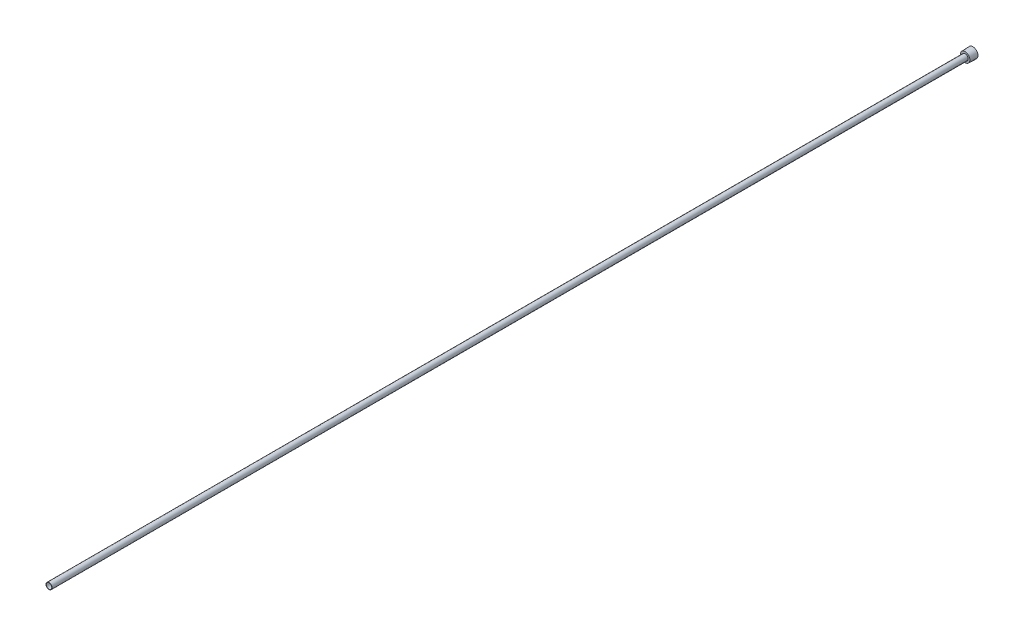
ISO-10303-21;
HEADER;
FILE_DESCRIPTION(('STEP AP214'),'2;1');
FILE_NAME('part.step','',(''),(''),'','','');
FILE_SCHEMA(('AUTOMOTIVE_DESIGN { 1 0 10303 214 1 1 1 1 }'));
ENDSEC;
DATA;
#1=APPLICATION_CONTEXT('core data for automotive mechanical design processes');
#2=APPLICATION_PROTOCOL_DEFINITION('international standard','automotive_design',2000,#1);
#3=PRODUCT_CONTEXT('',#1,'mechanical');
#4=PRODUCT('Part','Part','',(#3));
#5=PRODUCT_RELATED_PRODUCT_CATEGORY('part','',(#4));
#6=PRODUCT_DEFINITION_FORMATION('','',#4);
#7=PRODUCT_DEFINITION_CONTEXT('part definition',#1,'design');
#8=PRODUCT_DEFINITION('design','',#6,#7);
#9=PRODUCT_DEFINITION_SHAPE('','',#8);
#10=(LENGTH_UNIT() NAMED_UNIT(*) SI_UNIT(.MILLI.,.METRE.));
#11=(NAMED_UNIT(*) PLANE_ANGLE_UNIT() SI_UNIT($,.RADIAN.));
#12=(NAMED_UNIT(*) SI_UNIT($,.STERADIAN.) SOLID_ANGLE_UNIT());
#13=UNCERTAINTY_MEASURE_WITH_UNIT(LENGTH_MEASURE(1.E-05),#10,'distance_accuracy_value','');
#14=(GEOMETRIC_REPRESENTATION_CONTEXT(3) GLOBAL_UNCERTAINTY_ASSIGNED_CONTEXT((#13)) GLOBAL_UNIT_ASSIGNED_CONTEXT((#10,
#11,#12)) REPRESENTATION_CONTEXT('',''));
#15=CARTESIAN_POINT('',(0.,0.,0.));
#16=DIRECTION('',(0.,0.,1.));
#17=DIRECTION('',(1.,0.,0.));
#18=AXIS2_PLACEMENT_3D('',#15,#16,#17);
#19=CARTESIAN_POINT('',(0.,0.,0.));
#20=DIRECTION('',(0.,0.,1.));
#21=DIRECTION('',(1.,0.,0.));
#22=AXIS2_PLACEMENT_3D('',#19,#20,#21);
#23=CYLINDRICAL_SURFACE('',#22,3.65125);
#24=CARTESIAN_POINT('',(0.,0.,1219.2));
#25=DIRECTION('',(0.,0.,1.));
#26=DIRECTION('',(1.,0.,0.));
#27=AXIS2_PLACEMENT_3D('',#24,#25,#26);
#28=CIRCLE('',#27,3.65125);
#29=CARTESIAN_POINT('',(3.65125,0.,1219.2));
#30=VERTEX_POINT('',#29);
#31=EDGE_CURVE('E141',#30,#30,#28,.T.);
#32=CARTESIAN_POINT('',(0.,0.,6.35));
#33=DIRECTION('',(0.,0.,-1.));
#34=DIRECTION('',(-1.,0.,0.));
#35=AXIS2_PLACEMENT_3D('',#32,#33,#34);
#36=CIRCLE('',#35,3.65125);
#37=CARTESIAN_POINT('',(3.65125,0.,6.35));
#38=VERTEX_POINT('',#37);
#39=EDGE_CURVE('E36',#38,#38,#36,.F.);
#40=CARTESIAN_POINT('',(3.65125,0.,1219.2));
#41=CARTESIAN_POINT('',(3.65125,0.,1206.56614583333));
#42=CARTESIAN_POINT('',(3.65125,0.,1193.93229166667));
#43=CARTESIAN_POINT('',(3.65125,0.,1168.66458333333));
#44=CARTESIAN_POINT('',(3.65125,0.,1156.03072916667));
#45=CARTESIAN_POINT('',(3.65125,0.,1130.76302083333));
#46=CARTESIAN_POINT('',(3.65125,0.,1118.12916666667));
#47=CARTESIAN_POINT('',(3.65125,0.,1092.86145833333));
#48=CARTESIAN_POINT('',(3.65125,0.,1080.22760416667));
#49=CARTESIAN_POINT('',(3.65125,0.,1054.95989583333));
#50=CARTESIAN_POINT('',(3.65125,0.,1042.32604166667));
#51=CARTESIAN_POINT('',(3.65125,0.,1017.05833333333));
#52=CARTESIAN_POINT('',(3.65125,0.,1004.42447916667));
#53=CARTESIAN_POINT('',(3.65125,0.,979.156770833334));
#54=CARTESIAN_POINT('',(3.65125,0.,966.522916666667));
#55=CARTESIAN_POINT('',(3.65125,0.,941.255208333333));
#56=CARTESIAN_POINT('',(3.65125,0.,928.621354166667));
#57=CARTESIAN_POINT('',(3.65125,0.,903.353645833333));
#58=CARTESIAN_POINT('',(3.65125,0.,890.719791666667));
#59=CARTESIAN_POINT('',(3.65125,0.,865.452083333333));
#60=CARTESIAN_POINT('',(3.65125,0.,852.818229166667));
#61=CARTESIAN_POINT('',(3.65125,0.,827.550520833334));
#62=CARTESIAN_POINT('',(3.65125,0.,814.916666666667));
#63=CARTESIAN_POINT('',(3.65125,0.,789.648958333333));
#64=CARTESIAN_POINT('',(3.65125,0.,777.015104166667));
#65=CARTESIAN_POINT('',(3.65125,0.,751.747395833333));
#66=CARTESIAN_POINT('',(3.65125,0.,739.113541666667));
#67=CARTESIAN_POINT('',(3.65125,0.,713.845833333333));
#68=CARTESIAN_POINT('',(3.65125,0.,701.211979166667));
#69=CARTESIAN_POINT('',(3.65125,0.,675.944270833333));
#70=CARTESIAN_POINT('',(3.65125,0.,663.310416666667));
#71=CARTESIAN_POINT('',(3.65125,0.,638.042708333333));
#72=CARTESIAN_POINT('',(3.65125,0.,625.408854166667));
#73=CARTESIAN_POINT('',(3.65125,0.,600.141145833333));
#74=CARTESIAN_POINT('',(3.65125,0.,587.507291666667));
#75=CARTESIAN_POINT('',(3.65125,0.,562.239583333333));
#76=CARTESIAN_POINT('',(3.65125,0.,549.605729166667));
#77=CARTESIAN_POINT('',(3.65125,0.,524.338020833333));
#78=CARTESIAN_POINT('',(3.65125,0.,511.704166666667));
#79=CARTESIAN_POINT('',(3.65125,0.,486.436458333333));
#80=CARTESIAN_POINT('',(3.65125,0.,473.802604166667));
#81=CARTESIAN_POINT('',(3.65125,0.,448.534895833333));
#82=CARTESIAN_POINT('',(3.65125,0.,435.901041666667));
#83=CARTESIAN_POINT('',(3.65125,0.,410.633333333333));
#84=CARTESIAN_POINT('',(3.65125,0.,397.999479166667));
#85=CARTESIAN_POINT('',(3.65125,0.,372.731770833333));
#86=CARTESIAN_POINT('',(3.65125,0.,360.097916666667));
#87=CARTESIAN_POINT('',(3.65125,0.,334.830208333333));
#88=CARTESIAN_POINT('',(3.65125,0.,322.196354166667));
#89=CARTESIAN_POINT('',(3.65125,0.,296.928645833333));
#90=CARTESIAN_POINT('',(3.65125,0.,284.294791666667));
#91=CARTESIAN_POINT('',(3.65125,0.,259.027083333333));
#92=CARTESIAN_POINT('',(3.65125,0.,246.393229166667));
#93=CARTESIAN_POINT('',(3.65125,0.,221.125520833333));
#94=CARTESIAN_POINT('',(3.65125,0.,208.491666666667));
#95=CARTESIAN_POINT('',(3.65125,0.,183.223958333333));
#96=CARTESIAN_POINT('',(3.65125,0.,170.590104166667));
#97=CARTESIAN_POINT('',(3.65125,0.,145.322395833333));
#98=CARTESIAN_POINT('',(3.65125,0.,132.688541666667));
#99=CARTESIAN_POINT('',(3.65125,0.,107.420833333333));
#100=CARTESIAN_POINT('',(3.65125,0.,94.7869791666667));
#101=CARTESIAN_POINT('',(3.65125,0.,69.5192708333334));
#102=CARTESIAN_POINT('',(3.65125,0.,56.8854166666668));
#103=CARTESIAN_POINT('',(3.65125,0.,31.6177083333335));
#104=CARTESIAN_POINT('',(3.65125,0.,18.9838541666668));
#105=CARTESIAN_POINT('',(3.65125,0.,6.35000000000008));
#106=B_SPLINE_CURVE_WITH_KNOTS('',3,(#40,#41,#42,#43,#44,#45,#46,#47,#48,#49,#50,#51,#52,#53,
#54,#55,#56,#57,#58,#59,#60,#61,#62,#63,#64,#65,#66,#67,#68,#69,#70,#71,#72,#73,#74,#75,#76,#77,
#78,#79,#80,#81,#82,#83,#84,#85,#86,#87,#88,#89,#90,#91,#92,#93,#94,#95,#96,#97,#98,#99,#100,
#101,#102,#103,#104,#105),.UNSPECIFIED.,.F.,.F.,(4,2,2,2,2,2,2,2,2,2,2,2,2,2,2,2,2,2,2,2,2,2,2,
2,2,2,2,2,2,2,2,2,4),(0.,37.9015625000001,75.803125,113.7046875,151.60625,189.5078125,
227.409375,265.3109375,303.2125,341.1140625,379.015625,416.9171875,454.81875,492.7203125,
530.621875,568.5234375,606.425,644.3265625,682.228125,720.1296875,758.03125,795.9328125,
833.834375,871.7359375,909.6375,947.5390625,985.440625,1023.3421875,1061.24375,1099.1453125,
1137.046875,1174.9484375,1212.85),.UNSPECIFIED.);
#107=EDGE_CURVE('BSEAM32',#30,#38,#106,.T.);
#108=ORIENTED_EDGE('',*,*,#31,.T.);
#109=ORIENTED_EDGE('',*,*,#39,.F.);
#110=ORIENTED_EDGE('',*,*,#107,.T.);
#111=ORIENTED_EDGE('',*,*,#107,.F.);
#112=EDGE_LOOP('',(#108,#110,#109,#111));
#113=FACE_BOUND('',#112,.T.);
#114=ADVANCED_FACE('F32',(#113),#23,.F.);
#115=CARTESIAN_POINT('',(0.,0.,0.));
#116=DIRECTION('',(0.,0.,-1.));
#117=DIRECTION('',(-1.,0.,0.));
#118=AXIS2_PLACEMENT_3D('',#115,#116,#117);
#119=CONICAL_SURFACE('',#118,6.7183,0.0364599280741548);
#120=CARTESIAN_POINT('',(0.,0.,10.3124));
#121=DIRECTION('',(0.,0.,1.));
#122=DIRECTION('',(1.,0.,0.));
#123=AXIS2_PLACEMENT_3D('',#120,#121,#122);
#124=CIRCLE('',#123,6.34214394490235);
#125=CARTESIAN_POINT('',(6.34214394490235,0.,10.3124));
#126=VERTEX_POINT('',#125);
#127=EDGE_CURVE('E11',#126,#126,#124,.T.);
#128=ORIENTED_EDGE('',*,*,#127,.F.);
#129=EDGE_LOOP('',(#128));
#130=FACE_BOUND('',#129,.T.);
#131=CARTESIAN_POINT('',(0.,0.,0.));
#132=DIRECTION('',(0.,0.,1.));
#133=DIRECTION('',(1.,0.,0.));
#134=AXIS2_PLACEMENT_3D('',#131,#132,#133);
#135=CIRCLE('',#134,6.7183);
#136=CARTESIAN_POINT('',(6.7183,0.,0.));
#137=VERTEX_POINT('',#136);
#138=EDGE_CURVE('E144',#137,#137,#135,.T.);
#139=ORIENTED_EDGE('',*,*,#138,.T.);
#140=EDGE_LOOP('',(#139));
#141=FACE_BOUND('',#140,.T.);
#142=ADVANCED_FACE('F34',(#130,#141),#119,.T.);
#143=CARTESIAN_POINT('',(0.,6.34214394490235,10.3124));
#144=DIRECTION('',(0.,0.,-1.));
#145=DIRECTION('',(-1.,0.,0.));
#146=AXIS2_PLACEMENT_3D('',#143,#144,#145);
#147=PLANE('',#146);
#148=CARTESIAN_POINT('',(0.,0.,10.3124));
#149=DIRECTION('',(0.,0.,1.));
#150=DIRECTION('',(1.,0.,0.));
#151=AXIS2_PLACEMENT_3D('',#148,#149,#150);
#152=CIRCLE('',#151,3.96875);
#153=CARTESIAN_POINT('',(3.96875,0.,10.3124));
#154=VERTEX_POINT('',#153);
#155=EDGE_CURVE('E41',#154,#154,#152,.T.);
#156=ORIENTED_EDGE('',*,*,#155,.F.);
#157=EDGE_LOOP('',(#156));
#158=FACE_BOUND('',#157,.T.);
#159=ORIENTED_EDGE('',*,*,#127,.T.);
#160=EDGE_LOOP('',(#159));
#161=FACE_BOUND('',#160,.T.);
#162=ADVANCED_FACE('F155',(#158,#161),#147,.F.);
#163=CARTESIAN_POINT('',(0.,0.,331.124179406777));
#164=DIRECTION('',(0.,0.,1.));
#165=DIRECTION('',(1.,0.,0.));
#166=AXIS2_PLACEMENT_3D('',#163,#164,#165);
#167=CYLINDRICAL_SURFACE('',#166,3.96874999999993);
#168=CARTESIAN_POINT('',(0.,0.,1219.2));
#169=DIRECTION('',(0.,0.,1.));
#170=DIRECTION('',(1.,0.,0.));
#171=AXIS2_PLACEMENT_3D('',#168,#169,#170);
#172=CIRCLE('',#171,3.96874999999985);
#173=CARTESIAN_POINT('',(3.96874999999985,0.,1219.2));
#174=VERTEX_POINT('',#173);
#175=EDGE_CURVE('E147',#174,#174,#172,.T.);
#176=ORIENTED_EDGE('',*,*,#175,.F.);
#177=EDGE_LOOP('',(#176));
#178=FACE_BOUND('',#177,.T.);
#179=ORIENTED_EDGE('',*,*,#155,.T.);
#180=EDGE_LOOP('',(#179));
#181=FACE_BOUND('',#180,.T.);
#182=ADVANCED_FACE('F153',(#178,#181),#167,.T.);
#183=CARTESIAN_POINT('',(0.,3.96874999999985,1219.2));
#184=DIRECTION('',(0.,0.,-1.));
#185=DIRECTION('',(-1.,0.,0.));
#186=AXIS2_PLACEMENT_3D('',#183,#184,#185);
#187=PLANE('',#186);
#188=ORIENTED_EDGE('',*,*,#31,.F.);
#189=EDGE_LOOP('',(#188));
#190=FACE_BOUND('',#189,.T.);
#191=ORIENTED_EDGE('',*,*,#175,.T.);
#192=EDGE_LOOP('',(#191));
#193=FACE_BOUND('',#192,.T.);
#194=ADVANCED_FACE('F166',(#190,#193),#187,.F.);
#195=CARTESIAN_POINT('',(0.,0.,0.));
#196=DIRECTION('',(0.,0.,1.));
#197=DIRECTION('',(1.,0.,0.));
#198=AXIS2_PLACEMENT_3D('',#195,#196,#197);
#199=PLANE('',#198);
#200=DIRECTION('',(-0.866025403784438,-0.5,0.));
#201=VECTOR('',#200,1.);
#202=CARTESIAN_POINT('',(4.7625,-2.74963065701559,0.));
#203=LINE('',#202,#201);
#204=CARTESIAN_POINT('',(4.7625,-2.74963065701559,0.));
#205=VERTEX_POINT('',#204);
#206=CARTESIAN_POINT('',(0.,-5.49926131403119,0.));
#207=VERTEX_POINT('',#206);
#208=EDGE_CURVE('E123',#205,#207,#203,.T.);
#209=ORIENTED_EDGE('',*,*,#208,.F.);
#210=DIRECTION('',(0.,-1.,0.));
#211=VECTOR('',#210,1.);
#212=CARTESIAN_POINT('',(4.7625,2.74963065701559,0.));
#213=LINE('',#212,#211);
#214=CARTESIAN_POINT('',(4.7625,2.74963065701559,0.));
#215=VERTEX_POINT('',#214);
#216=EDGE_CURVE('E48',#215,#205,#213,.T.);
#217=ORIENTED_EDGE('',*,*,#216,.F.);
#218=DIRECTION('',(0.866025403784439,-0.5,0.));
#219=VECTOR('',#218,1.);
#220=CARTESIAN_POINT('',(0.,5.49926131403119,0.));
#221=LINE('',#220,#219);
#222=CARTESIAN_POINT('',(0.,5.49926131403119,0.));
#223=VERTEX_POINT('',#222);
#224=EDGE_CURVE('E132',#223,#215,#221,.T.);
#225=ORIENTED_EDGE('',*,*,#224,.F.);
#226=DIRECTION('',(0.866025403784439,0.5,0.));
#227=VECTOR('',#226,1.);
#228=CARTESIAN_POINT('',(-4.7625,2.7496306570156,0.));
#229=LINE('',#228,#227);
#230=CARTESIAN_POINT('',(-4.7625,2.7496306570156,0.));
#231=VERTEX_POINT('',#230);
#232=EDGE_CURVE('E130',#231,#223,#229,.T.);
#233=ORIENTED_EDGE('',*,*,#232,.F.);
#234=DIRECTION('',(0.,1.,0.));
#235=VECTOR('',#234,1.);
#236=CARTESIAN_POINT('',(-4.7625,-2.74963065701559,0.));
#237=LINE('',#236,#235);
#238=CARTESIAN_POINT('',(-4.7625,-2.74963065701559,0.));
#239=VERTEX_POINT('',#238);
#240=EDGE_CURVE('E96',#239,#231,#237,.T.);
#241=ORIENTED_EDGE('',*,*,#240,.F.);
#242=DIRECTION('',(-0.866025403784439,0.5,0.));
#243=VECTOR('',#242,1.);
#244=CARTESIAN_POINT('',(0.,-5.49926131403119,0.));
#245=LINE('',#244,#243);
#246=EDGE_CURVE('E126',#207,#239,#245,.T.);
#247=ORIENTED_EDGE('',*,*,#246,.F.);
#248=EDGE_LOOP('',(#209,#217,#225,#233,#241,#247));
#249=FACE_BOUND('',#248,.T.);
#250=ORIENTED_EDGE('',*,*,#138,.F.);
#251=EDGE_LOOP('',(#250));
#252=FACE_BOUND('',#251,.T.);
#253=ADVANCED_FACE('F164',(#249,#252),#199,.F.);
#254=CARTESIAN_POINT('',(4.7625,-2.74963065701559,6.35));
#255=DIRECTION('',(0.,0.,-1.));
#256=DIRECTION('',(-1.,0.,0.));
#257=AXIS2_PLACEMENT_3D('',#254,#255,#256);
#258=PLANE('',#257);
#259=DIRECTION('',(0.,-1.,0.));
#260=VECTOR('',#259,1.);
#261=CARTESIAN_POINT('',(4.7625,2.74963065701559,6.35));
#262=LINE('',#261,#260);
#263=CARTESIAN_POINT('',(4.7625,2.74963065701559,6.35));
#264=VERTEX_POINT('',#263);
#265=CARTESIAN_POINT('',(4.7625,-2.74963065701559,6.35));
#266=VERTEX_POINT('',#265);
#267=EDGE_CURVE('E134',#264,#266,#262,.T.);
#268=ORIENTED_EDGE('',*,*,#267,.T.);
#269=DIRECTION('',(-0.866025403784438,-0.5,0.));
#270=VECTOR('',#269,1.);
#271=CARTESIAN_POINT('',(4.7625,-2.74963065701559,6.35));
#272=LINE('',#271,#270);
#273=CARTESIAN_POINT('',(0.,-5.49926131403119,6.35));
#274=VERTEX_POINT('',#273);
#275=EDGE_CURVE('E117',#266,#274,#272,.T.);
#276=ORIENTED_EDGE('',*,*,#275,.T.);
#277=DIRECTION('',(-0.866025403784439,0.5,0.));
#278=VECTOR('',#277,1.);
#279=CARTESIAN_POINT('',(0.,-5.49926131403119,6.35));
#280=LINE('',#279,#278);
#281=CARTESIAN_POINT('',(-4.7625,-2.74963065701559,6.35));
#282=VERTEX_POINT('',#281);
#283=EDGE_CURVE('E115',#274,#282,#280,.T.);
#284=ORIENTED_EDGE('',*,*,#283,.T.);
#285=DIRECTION('',(0.,1.,0.));
#286=VECTOR('',#285,1.);
#287=CARTESIAN_POINT('',(-4.7625,-2.74963065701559,6.35));
#288=LINE('',#287,#286);
#289=CARTESIAN_POINT('',(-4.7625,2.7496306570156,6.35));
#290=VERTEX_POINT('',#289);
#291=EDGE_CURVE('E93',#282,#290,#288,.T.);
#292=ORIENTED_EDGE('',*,*,#291,.T.);
#293=DIRECTION('',(0.866025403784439,0.5,0.));
#294=VECTOR('',#293,1.);
#295=CARTESIAN_POINT('',(-4.7625,2.7496306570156,6.35));
#296=LINE('',#295,#294);
#297=CARTESIAN_POINT('',(0.,5.49926131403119,6.35));
#298=VERTEX_POINT('',#297);
#299=EDGE_CURVE('E104',#290,#298,#296,.T.);
#300=ORIENTED_EDGE('',*,*,#299,.T.);
#301=DIRECTION('',(0.866025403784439,-0.5,0.));
#302=VECTOR('',#301,1.);
#303=CARTESIAN_POINT('',(0.,5.49926131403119,6.35));
#304=LINE('',#303,#302);
#305=EDGE_CURVE('E108',#298,#264,#304,.T.);
#306=ORIENTED_EDGE('',*,*,#305,.T.);
#307=EDGE_LOOP('',(#268,#276,#284,#292,#300,#306));
#308=FACE_BOUND('',#307,.T.);
#309=ORIENTED_EDGE('',*,*,#39,.T.);
#310=EDGE_LOOP('',(#309));
#311=FACE_BOUND('',#310,.T.);
#312=ADVANCED_FACE('F111',(#308,#311),#258,.T.);
#313=CARTESIAN_POINT('',(4.7625,2.74963065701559,6.35));
#314=DIRECTION('',(1.,0.,0.));
#315=DIRECTION('',(0.,1.,0.));
#316=AXIS2_PLACEMENT_3D('',#313,#314,#315);
#317=PLANE('',#316);
#318=ORIENTED_EDGE('',*,*,#216,.T.);
#319=DIRECTION('',(0.,0.,-1.));
#320=VECTOR('',#319,1.);
#321=CARTESIAN_POINT('',(4.7625,-2.74963065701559,6.35));
#322=LINE('',#321,#320);
#323=EDGE_CURVE('E78',#266,#205,#322,.T.);
#324=ORIENTED_EDGE('',*,*,#323,.F.);
#325=ORIENTED_EDGE('',*,*,#267,.F.);
#326=DIRECTION('',(0.,0.,-1.));
#327=VECTOR('',#326,1.);
#328=CARTESIAN_POINT('',(4.7625,2.74963065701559,6.35));
#329=LINE('',#328,#327);
#330=EDGE_CURVE('E56',#264,#215,#329,.T.);
#331=ORIENTED_EDGE('',*,*,#330,.T.);
#332=EDGE_LOOP('',(#318,#324,#325,#331));
#333=FACE_BOUND('',#332,.T.);
#334=ADVANCED_FACE('F173',(#333),#317,.F.);
#335=CARTESIAN_POINT('',(0.,5.49926131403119,6.35));
#336=DIRECTION('',(0.5,0.866025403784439,0.));
#337=DIRECTION('',(-0.866025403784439,0.5,0.));
#338=AXIS2_PLACEMENT_3D('',#335,#336,#337);
#339=PLANE('',#338);
#340=ORIENTED_EDGE('',*,*,#224,.T.);
#341=ORIENTED_EDGE('',*,*,#330,.F.);
#342=ORIENTED_EDGE('',*,*,#305,.F.);
#343=DIRECTION('',(0.,0.,-1.));
#344=VECTOR('',#343,1.);
#345=CARTESIAN_POINT('',(0.,5.49926131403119,6.35));
#346=LINE('',#345,#344);
#347=EDGE_CURVE('E100',#298,#223,#346,.T.);
#348=ORIENTED_EDGE('',*,*,#347,.T.);
#349=EDGE_LOOP('',(#340,#341,#342,#348));
#350=FACE_BOUND('',#349,.T.);
#351=ADVANCED_FACE('F187',(#350),#339,.F.);
#352=CARTESIAN_POINT('',(-4.7625,2.7496306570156,6.35));
#353=DIRECTION('',(-0.5,0.866025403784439,0.));
#354=DIRECTION('',(-0.866025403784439,-0.5,0.));
#355=AXIS2_PLACEMENT_3D('',#352,#353,#354);
#356=PLANE('',#355);
#357=ORIENTED_EDGE('',*,*,#232,.T.);
#358=ORIENTED_EDGE('',*,*,#347,.F.);
#359=ORIENTED_EDGE('',*,*,#299,.F.);
#360=DIRECTION('',(0.,0.,-1.));
#361=VECTOR('',#360,1.);
#362=CARTESIAN_POINT('',(-4.7625,2.7496306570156,6.35));
#363=LINE('',#362,#361);
#364=EDGE_CURVE('E89',#290,#231,#363,.T.);
#365=ORIENTED_EDGE('',*,*,#364,.T.);
#366=EDGE_LOOP('',(#357,#358,#359,#365));
#367=FACE_BOUND('',#366,.T.);
#368=ADVANCED_FACE('F105',(#367),#356,.F.);
#369=CARTESIAN_POINT('',(-4.7625,-2.74963065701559,6.35));
#370=DIRECTION('',(-1.,0.,0.));
#371=DIRECTION('',(0.,0.,1.));
#372=AXIS2_PLACEMENT_3D('',#369,#370,#371);
#373=PLANE('',#372);
#374=ORIENTED_EDGE('',*,*,#240,.T.);
#375=ORIENTED_EDGE('',*,*,#364,.F.);
#376=ORIENTED_EDGE('',*,*,#291,.F.);
#377=DIRECTION('',(0.,0.,-1.));
#378=VECTOR('',#377,1.);
#379=CARTESIAN_POINT('',(-4.7625,-2.74963065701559,6.35));
#380=LINE('',#379,#378);
#381=EDGE_CURVE('E101',#282,#239,#380,.T.);
#382=ORIENTED_EDGE('',*,*,#381,.T.);
#383=EDGE_LOOP('',(#374,#375,#376,#382));
#384=FACE_BOUND('',#383,.T.);
#385=ADVANCED_FACE('F91',(#384),#373,.F.);
#386=CARTESIAN_POINT('',(0.,-5.49926131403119,6.35));
#387=DIRECTION('',(-0.5,-0.866025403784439,0.));
#388=DIRECTION('',(0.866025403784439,-0.5,0.));
#389=AXIS2_PLACEMENT_3D('',#386,#387,#388);
#390=PLANE('',#389);
#391=ORIENTED_EDGE('',*,*,#246,.T.);
#392=ORIENTED_EDGE('',*,*,#381,.F.);
#393=ORIENTED_EDGE('',*,*,#283,.F.);
#394=DIRECTION('',(0.,0.,-1.));
#395=VECTOR('',#394,1.);
#396=CARTESIAN_POINT('',(0.,-5.49926131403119,6.35));
#397=LINE('',#396,#395);
#398=EDGE_CURVE('E138',#274,#207,#397,.T.);
#399=ORIENTED_EDGE('',*,*,#398,.T.);
#400=EDGE_LOOP('',(#391,#392,#393,#399));
#401=FACE_BOUND('',#400,.T.);
#402=ADVANCED_FACE('F191',(#401),#390,.F.);
#403=CARTESIAN_POINT('',(4.7625,-2.74963065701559,6.35));
#404=DIRECTION('',(0.5,-0.866025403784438,0.));
#405=DIRECTION('',(0.866025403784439,0.5,0.));
#406=AXIS2_PLACEMENT_3D('',#403,#404,#405);
#407=PLANE('',#406);
#408=ORIENTED_EDGE('',*,*,#208,.T.);
#409=ORIENTED_EDGE('',*,*,#398,.F.);
#410=ORIENTED_EDGE('',*,*,#275,.F.);
#411=ORIENTED_EDGE('',*,*,#323,.T.);
#412=EDGE_LOOP('',(#408,#409,#410,#411));
#413=FACE_BOUND('',#412,.T.);
#414=ADVANCED_FACE('F188',(#413),#407,.F.);
#415=CLOSED_SHELL('',(#114,#142,#162,#182,#194,#253,#312,#334,#351,#368,#385,#402,#414));
#416=MANIFOLD_SOLID_BREP('B2',#415);
#417=ADVANCED_BREP_SHAPE_REPRESENTATION('',(#18,#416),#14);
#418=SHAPE_DEFINITION_REPRESENTATION(#9,#417);
ENDSEC;
END-ISO-10303-21;
